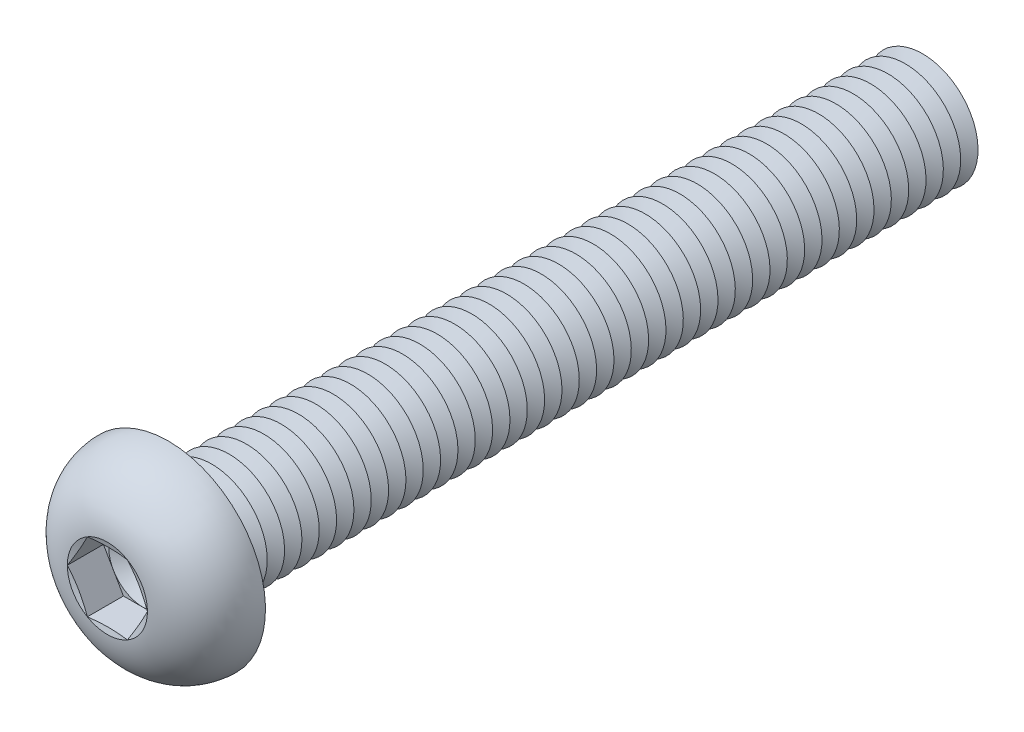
from build123d import *

# Parameters (mm, degrees)
FILLET1_R          = 0.625
LPATTERN1_COUNT    = 44
LPATTERN1_PITCH    = 1.25
CUT_EXTRUDE1_DEPTH = 2.6


with BuildPart() as part:
    # Sketch1 → Revolve1 (revolve)
    with BuildSketch(Plane(origin=(0, 0, 0), x_dir=(0, 0, -1), z_dir=(1, 0, 0))):
        with BuildLine():
            Line((0, 4), (0, 7))
            ThreePointArc((0, 7), (-3.011595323, 5.81154966), (-4.4, 2.88675))
            Line((-4.4, 2.88675), (-4.013248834, 1.443375))
            Line((-4.013248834, 1.443375), (-4.4, 1.443375))
            Line((-4.4, 1.443375), (-4.4, 0))
            Line((-4.4, 0), (55, 0))
            Line((55, 0), (55, 4))
            Line((55, 4), (0, 4))
        make_face()
    revolve(axis=Axis((0, 0, -55), (0, 0, 1)))

    # Fillet1
    fillet1_edges = [part.edges().sort_by_distance(p)[0] for p in [
        (0, -4, 0),
    ]]
    fillet(fillet1_edges, radius=FILLET1_R)

    # Sketch2 → Cut-Revolve1 (revolve, cut)
    with BuildSketch(Plane(origin=(0, 0, 0), x_dir=(0, 0, -1), z_dir=(1, 0, 0))):
        Polygon((54.375, 4), (55.625, 4), (55, 2.917468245), align=None)
    cut_revolve1 = revolve(axis=Axis((0, 0, -55), (0, 0, -1)), mode=Mode.SUBTRACT)

    # LPattern1: Cut-Revolve1 ×44
    with Locations(*[(0, 0, i * LPATTERN1_PITCH) for i in range(1, LPATTERN1_COUNT)]):
        add(cut_revolve1, mode=Mode.SUBTRACT)

    # Sketch3 → Cut-Extrude1 (cut)
    with BuildSketch(Plane.XY.offset(4.4)):
        Polygon((1.443375, 2.499998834), (-1.443375, 2.499998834), (-2.88675, 0), (-1.443375, -2.499998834), (1.443375, -2.499998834), (2.88675, 0), align=None)
    extrude(amount=-CUT_EXTRUDE1_DEPTH, mode=Mode.SUBTRACT)

    # Cut-Extrude2 cone 1 section (on through the dimple's axis) → Cut-Extrude2 (revolve, cut)
    with BuildSketch(Plane(origin=(0, 0, 1.8), x_dir=(0, -1, 0), z_dir=(1, 0, 0))):
        Polygon((0, 0), (2.499998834, 0), (0, 1.443375), align=None)
    revolve(axis=Axis((0, 0, 1.8), (0, 0, -1)), mode=Mode.SUBTRACT)


solid = part.part
